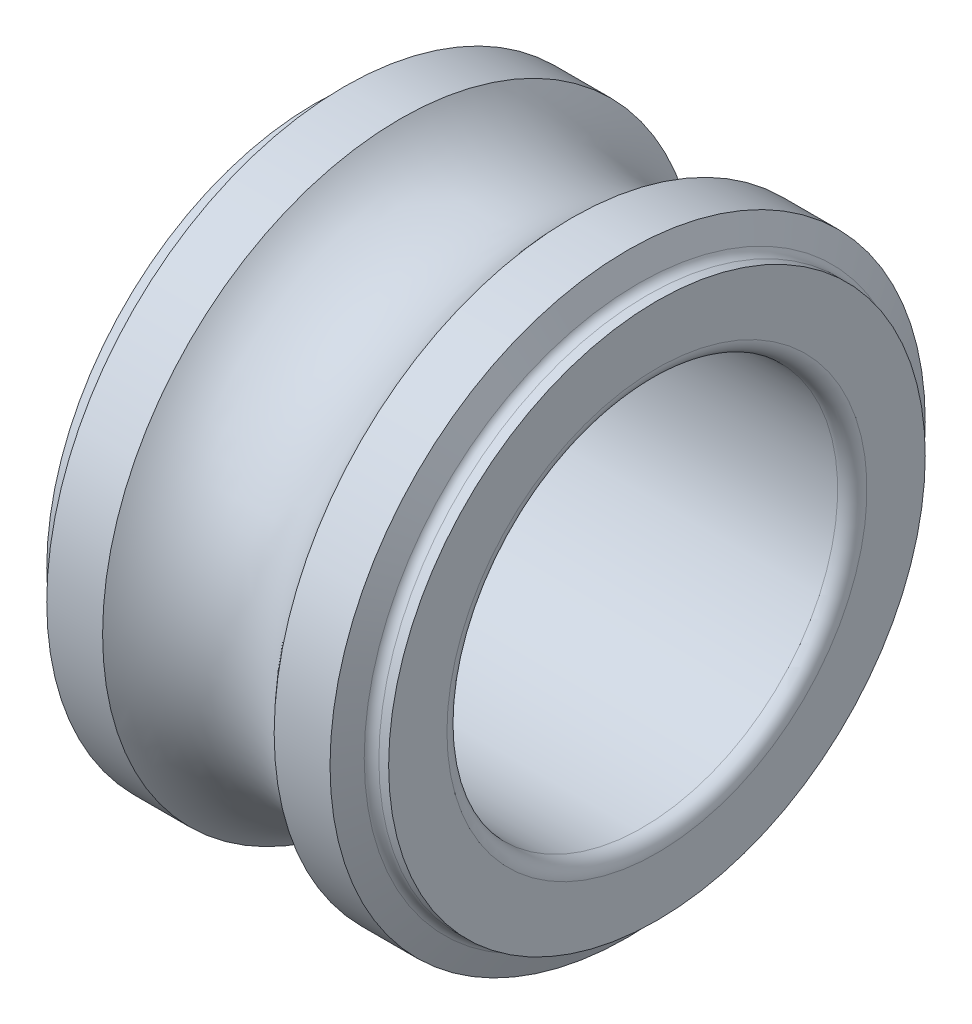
from build123d import *


with BuildPart() as part:
    # Esquisse1 → Base-R_volution (revolve)
    with BuildSketch(Plane.XY, mode=Mode.PRIVATE) as base_r_volution_sk:
        with BuildLine():
            Line((7, 4.3), (7, 5.49375))
            Line((7, 5.49375), (6.8, 5.49375))
            ThreePointArc((6.8, 5.49375), (6.691504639, 5.525735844), (6.617712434, 5.611462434))
            Line((6.617712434, 5.611462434), (6.4, 6.09375))
            Line((6.4, 6.09375), (5.256405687, 6.09375))
            ThreePointArc((5.256405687, 6.09375), (3.5, 5.25), (1.743594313, 6.09375))
            Line((1.743594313, 6.09375), (0.6, 6.09375))
            Line((0.6, 6.09375), (0.382287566, 5.611462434))
            ThreePointArc((0.382287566, 5.611462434), (0.308495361, 5.525735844), (0.2, 5.49375))
            Line((0.2, 5.49375), (0, 5.49375))
            Line((0, 5.49375), (0, 4.3))
            ThreePointArc((0, 4.3), (0.087867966, 4.087867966), (0.3, 4))
            Line((0.3, 4), (6.7, 4))
            ThreePointArc((6.7, 4), (6.912132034, 4.087867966), (7, 4.3))
        make_face()
    revolve(base_r_volution_sk.sketch.rotate(Axis((-13, 0, 0), (1, 0, 0)), 90), axis=Axis((-13, 0, 0), (1, 0, 0)))


solid = part.part
